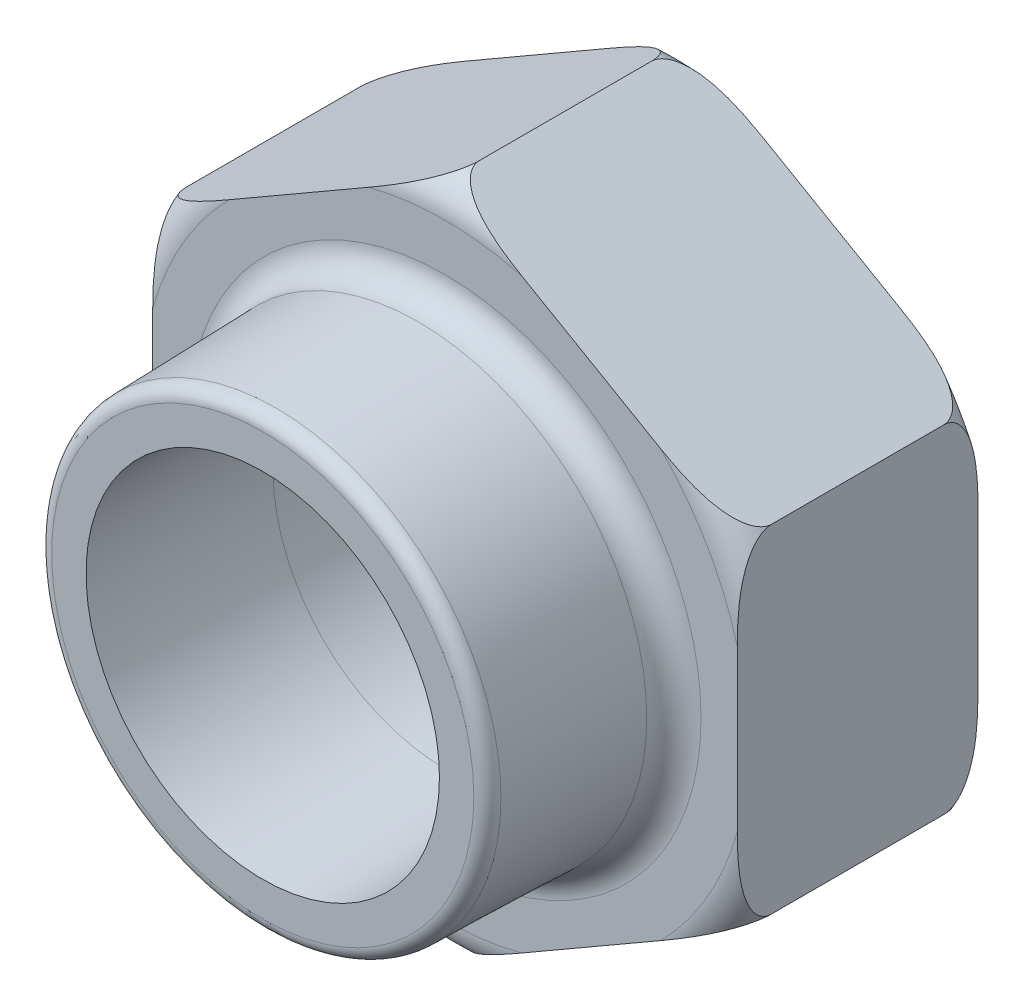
from build123d import *

# Parameters (mm, degrees)
TETE_DEPTH                 = 7
ESQUISSE3_R                = 5
ENL_V_DE_MAT_EXTRU_1_DEPTH = 15.750706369
ESQUISSE4_R                = 6.666666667
ESQUISSE4_R_2              = 5
BOSS_EXTRU_1_DEPTH         = 5.3
BOSS_EXTRU_1_DRAFT         = 1.499999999
CONG_1_R                   = 0.8
CONG_3_R                   = 0.4


with BuildPart() as part:
    # Esquisse1 → Tete (new body)
    with BuildSketch(Plane.XY):
        Polygon((-8.5, 4.907477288), (-8.5, -4.907477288), (0, -9.814954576), (8.5, -4.907477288), (8.5, 4.907477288), (0, 9.814954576), align=None)
    extrude(amount=TETE_DEPTH)

    # Esquisse2 → Rayon de tete (revolve, cut)
    with BuildSketch(Plane(origin=(0, 0, 0), x_dir=(0, 0, -1), z_dir=(1, 0, 0))):
        with BuildLine():
            Line((-1, -9.814954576), (-1, -19.814954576))
            Line((-1, -19.814954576), (8.771054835, -19.814954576))
            Line((8.771054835, -19.814954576), (8.771054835, -8.814954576))
            Line((8.771054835, -8.814954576), (0, -8.814954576))
            ThreePointArc((0, -8.814954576), (-0.292893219, -9.522061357), (-1, -9.814954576))
        make_face()
    rayon_de_tete = revolve(axis=Axis((0, 0, 0), (0, 0, 1)), mode=Mode.SUBTRACT)

    # Sym_trie1: Rayon de tete across plane
    add(rayon_de_tete.mirror(Plane.XY.offset(3.5)), mode=Mode.SUBTRACT)

    # Esquisse3 → Enl_v. de mat.-Extru.1 (cut, through all)
    with BuildSketch(Plane(origin=(0, 0, 0), x_dir=(-1, 0, 0), z_dir=(0, 0, -1))):
        Circle(ESQUISSE3_R)
    extrude(amount=-ENL_V_DE_MAT_EXTRU_1_DEPTH, mode=Mode.SUBTRACT)


with BuildPart() as boss_extru_1_tool:
    # Esquisse4 → Boss.-Extru.1 (with draft: the straight prism first)
    with BuildSketch(Plane.XY.offset(7)):
        Circle(ESQUISSE4_R)
        with Locations(Location((0, 0, 0), (0, 0, 180))):
            Circle(ESQUISSE4_R_2, mode=Mode.SUBTRACT)
    extrude(amount=BOSS_EXTRU_1_DEPTH)
    # Boss.-Extru.1: the draft: its side faces are tilted about the plane it starts from
    boss_extru_1_sides = [boss_extru_1_tool.faces().sort_by_distance(p)[0] for p in [
        (-6.666666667, 0, 9.65),
        (5, 0, 9.65),
    ]]
    draft(boss_extru_1_sides, Plane.XY.offset(7), BOSS_EXTRU_1_DRAFT)


with BuildPart() as part_1:
    add(part.part)

    # Boss.-Extru.1: add boss_extru_1_tool
    add(boss_extru_1_tool.part)

    # Cong_1
    cong_1_edges = [part_1.edges().sort_by_distance(p)[0] for p in [
        (-6.666666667, 0, 7),
    ]]
    fillet(cong_1_edges, radius=CONG_1_R)

    # Cong_3
    cong_3_edges = [part_1.edges().sort_by_distance(p)[0] for p in [
        (-6.527881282, 0, 12.3),
    ]]
    fillet(cong_3_edges, radius=CONG_3_R)


solid = part_1.part
